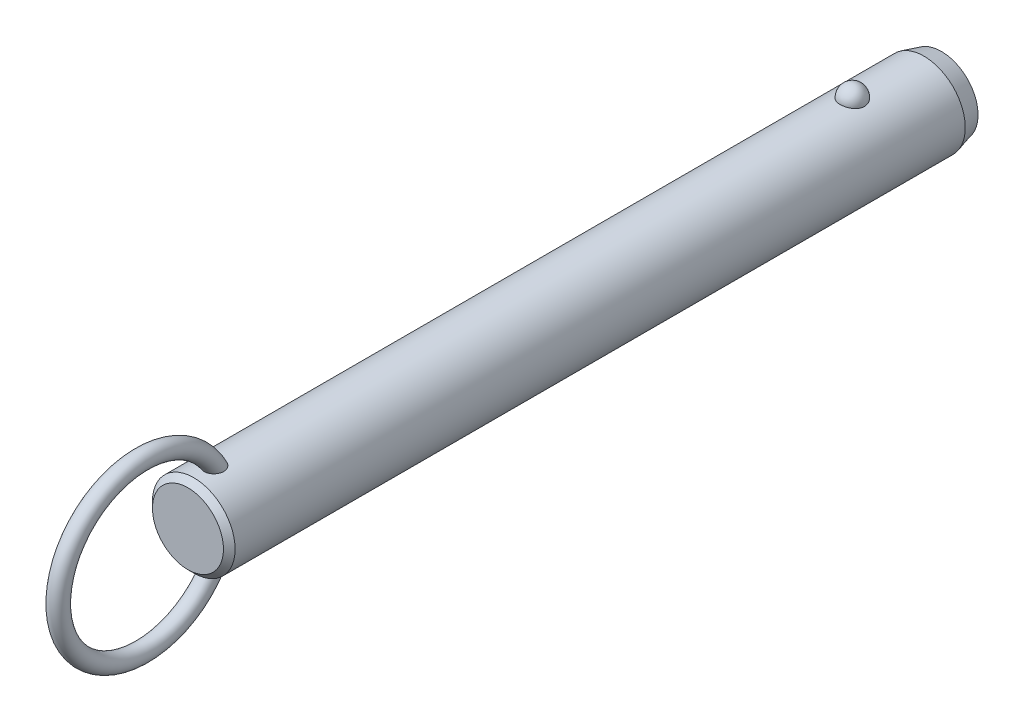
ISO-10303-21;
HEADER;
FILE_DESCRIPTION(('STEP AP214'),'2;1');
FILE_NAME('part.step','',(''),(''),'','','');
FILE_SCHEMA(('AUTOMOTIVE_DESIGN { 1 0 10303 214 1 1 1 1 }'));
ENDSEC;
DATA;
#1=APPLICATION_CONTEXT('core data for automotive mechanical design processes');
#2=APPLICATION_PROTOCOL_DEFINITION('international standard','automotive_design',2000,#1);
#3=PRODUCT_CONTEXT('',#1,'mechanical');
#4=PRODUCT('Part','Part','',(#3));
#5=PRODUCT_RELATED_PRODUCT_CATEGORY('part','',(#4));
#6=PRODUCT_DEFINITION_FORMATION('','',#4);
#7=PRODUCT_DEFINITION_CONTEXT('part definition',#1,'design');
#8=PRODUCT_DEFINITION('design','',#6,#7);
#9=PRODUCT_DEFINITION_SHAPE('','',#8);
#10=(LENGTH_UNIT() NAMED_UNIT(*) SI_UNIT(.MILLI.,.METRE.));
#11=(NAMED_UNIT(*) PLANE_ANGLE_UNIT() SI_UNIT($,.RADIAN.));
#12=(NAMED_UNIT(*) SI_UNIT($,.STERADIAN.) SOLID_ANGLE_UNIT());
#13=UNCERTAINTY_MEASURE_WITH_UNIT(LENGTH_MEASURE(1.E-05),#10,'distance_accuracy_value','');
#14=(GEOMETRIC_REPRESENTATION_CONTEXT(3) GLOBAL_UNCERTAINTY_ASSIGNED_CONTEXT((#13)) GLOBAL_UNIT_ASSIGNED_CONTEXT((#10,
#11,#12)) REPRESENTATION_CONTEXT('',''));
#15=CARTESIAN_POINT('',(0.,0.,0.));
#16=DIRECTION('',(0.,0.,1.));
#17=DIRECTION('',(1.,0.,0.));
#18=AXIS2_PLACEMENT_3D('',#15,#16,#17);
#19=CARTESIAN_POINT('',(0.,0.,104.1));
#20=DIRECTION('',(0.,0.,-1.));
#21=DIRECTION('',(-1.,0.,0.));
#22=AXIS2_PLACEMENT_3D('',#19,#20,#21);
#23=CYLINDRICAL_SURFACE('',#22,7.1);
#24=CARTESIAN_POINT('',(2.0769088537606,6.78943661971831,-2.1));
#25=CARTESIAN_POINT('',(2.07690739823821,6.78943796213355,-1.98268154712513));
#26=CARTESIAN_POINT('',(2.06738130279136,6.79237331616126,-1.86534506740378));
#27=CARTESIAN_POINT('',(2.0295040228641,6.8037853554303,-1.63400788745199));
#28=CARTESIAN_POINT('',(2.00114757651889,6.81226358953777,-1.52000812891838));
#29=CARTESIAN_POINT('',(1.92632025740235,6.83379798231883,-1.29863433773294));
#30=CARTESIAN_POINT('',(1.87985726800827,6.84685214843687,-1.19125744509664));
#31=CARTESIAN_POINT('',(1.76995205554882,6.87608091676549,-0.98604657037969));
#32=CARTESIAN_POINT('',(1.70650980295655,6.8922555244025,-0.88821260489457));
#33=CARTESIAN_POINT('',(1.5638119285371,6.92602930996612,-0.704242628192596));
#34=CARTESIAN_POINT('',(1.4844714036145,6.94363582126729,-0.618173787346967));
#35=CARTESIAN_POINT('',(1.31221746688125,6.97823658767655,-0.460740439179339));
#36=CARTESIAN_POINT('',(1.21930409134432,6.99523084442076,-0.389375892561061));
#37=CARTESIAN_POINT('',(1.02268781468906,7.02666176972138,-0.263547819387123));
#38=CARTESIAN_POINT('',(0.91902009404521,7.04110638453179,-0.209031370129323));
#39=CARTESIAN_POINT('',(0.703548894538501,7.06588726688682,-0.118163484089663));
#40=CARTESIAN_POINT('',(0.591746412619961,7.07622403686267,-0.0818098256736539));
#41=CARTESIAN_POINT('',(0.365557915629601,7.09147068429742,-0.0288711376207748));
#42=CARTESIAN_POINT('',(0.251267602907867,7.09648447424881,-0.0119070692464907));
#43=CARTESIAN_POINT('',(0.0213499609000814,7.10089837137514,0.00304925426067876));
#44=CARTESIAN_POINT('',(-0.0942772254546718,7.10029907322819,0.00104351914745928));
#45=CARTESIAN_POINT('',(-0.321651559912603,7.09360829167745,-0.0216931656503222));
#46=CARTESIAN_POINT('',(-0.433431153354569,7.08760388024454,-0.0421272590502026));
#47=CARTESIAN_POINT('',(-0.651862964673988,7.07086131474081,-0.100729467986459));
#48=CARTESIAN_POINT('',(-0.758515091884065,7.06012307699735,-0.138897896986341));
#49=CARTESIAN_POINT('',(-0.964449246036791,7.03496097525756,-0.232213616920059));
#50=CARTESIAN_POINT('',(-1.06368095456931,7.02051445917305,-0.287465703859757));
#51=CARTESIAN_POINT('',(-1.25145353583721,6.98948740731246,-0.413383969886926));
#52=CARTESIAN_POINT('',(-1.33999321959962,6.97290663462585,-0.48405186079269));
#53=CARTESIAN_POINT('',(-1.50591604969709,6.93898770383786,-0.640594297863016));
#54=CARTESIAN_POINT('',(-1.58302488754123,6.92164094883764,-0.726757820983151));
#55=CARTESIAN_POINT('',(-1.72189320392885,6.8884103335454,-0.91092752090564));
#56=CARTESIAN_POINT('',(-1.78365144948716,6.87252659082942,-1.008934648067));
#57=CARTESIAN_POINT('',(-1.89101272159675,6.84377189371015,-1.21549497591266));
#58=CARTESIAN_POINT('',(-1.93639553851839,6.83094274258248,-1.32416860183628));
#59=CARTESIAN_POINT('',(-2.00874275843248,6.81002070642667,-1.54791500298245));
#60=CARTESIAN_POINT('',(-2.03570774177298,6.80192767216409,-1.66298757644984));
#61=CARTESIAN_POINT('',(-2.07047276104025,6.7914266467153,-1.89571453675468));
#62=CARTESIAN_POINT('',(-2.07835878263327,6.78899315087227,-2.01335491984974));
#63=CARTESIAN_POINT('',(-2.07502083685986,6.79001409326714,-2.24833570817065));
#64=CARTESIAN_POINT('',(-2.06379746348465,6.7934683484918,-2.36567612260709));
#65=CARTESIAN_POINT('',(-2.02263913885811,6.80583442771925,-2.59603194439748));
#66=CARTESIAN_POINT('',(-1.99281127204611,6.81471501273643,-2.70906820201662));
#67=CARTESIAN_POINT('',(-1.91526639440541,6.83691232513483,-2.92836575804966));
#68=CARTESIAN_POINT('',(-1.8675486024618,6.85022924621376,-3.03462676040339));
#69=CARTESIAN_POINT('',(-1.75504492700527,6.87991336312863,-3.23806487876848));
#70=CARTESIAN_POINT('',(-1.69015924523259,6.89629822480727,-3.33518422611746));
#71=CARTESIAN_POINT('',(-1.54505404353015,6.93024852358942,-3.51697105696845));
#72=CARTESIAN_POINT('',(-1.46483385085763,6.94781401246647,-3.60163799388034));
#73=CARTESIAN_POINT('',(-1.29071406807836,6.98225977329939,-3.75654119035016));
#74=CARTESIAN_POINT('',(-1.19675650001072,6.99913673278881,-3.82671308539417));
#75=CARTESIAN_POINT('',(-0.997940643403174,7.03023618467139,-3.9501837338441));
#76=CARTESIAN_POINT('',(-0.89308318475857,7.04445887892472,-4.00348377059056));
#77=CARTESIAN_POINT('',(-0.676902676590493,7.06848365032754,-4.09107242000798));
#78=CARTESIAN_POINT('',(-0.565686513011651,7.0783430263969,-4.12560889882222));
#79=CARTESIAN_POINT('',(-0.338739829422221,7.09282534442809,-4.17575450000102));
#80=CARTESIAN_POINT('',(-0.223009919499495,7.09744899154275,-4.19136617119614));
#81=CARTESIAN_POINT('',(0.00707628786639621,7.10090930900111,-4.20307965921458));
#82=CARTESIAN_POINT('',(0.121410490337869,7.09986531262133,-4.19958377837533));
#83=CARTESIAN_POINT('',(0.347815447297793,7.092380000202,-4.17411564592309));
#84=CARTESIAN_POINT('',(0.459886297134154,7.08593891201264,-4.15214417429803));
#85=CARTESIAN_POINT('',(0.678084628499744,7.06838983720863,-4.09049562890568));
#86=CARTESIAN_POINT('',(0.784237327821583,7.05730369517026,-4.05090137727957));
#87=CARTESIAN_POINT('',(0.988305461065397,7.03163139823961,-3.95511447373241));
#88=CARTESIAN_POINT('',(1.08622031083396,7.01704499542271,-3.89892064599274));
#89=CARTESIAN_POINT('',(1.27284490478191,6.98562668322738,-3.77035541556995));
#90=CARTESIAN_POINT('',(1.36137372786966,6.96876135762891,-3.69772964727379));
#91=CARTESIAN_POINT('',(1.52509486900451,6.93477412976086,-3.53878279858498));
#92=CARTESIAN_POINT('',(1.60028496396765,6.91765218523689,-3.45245943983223));
#93=CARTESIAN_POINT('',(1.73681688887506,6.88465753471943,-3.26658774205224));
#94=CARTESIAN_POINT('',(1.79785966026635,6.86881574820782,-3.16681408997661));
#95=CARTESIAN_POINT('',(1.90265327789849,6.84053157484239,-2.95814408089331));
#96=CARTESIAN_POINT('',(1.94640861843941,6.82808830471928,-2.84925010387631));
#97=CARTESIAN_POINT('',(2.01274378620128,6.80881460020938,-2.63454318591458));
#98=CARTESIAN_POINT('',(2.03676193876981,6.80160856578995,-2.52920574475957));
#99=CARTESIAN_POINT('',(2.06884490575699,6.79191902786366,-2.3159172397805));
#100=CARTESIAN_POINT('',(2.07691019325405,6.78943538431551,-2.20796625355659));
#101=CARTESIAN_POINT('',(2.0769088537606,6.78943661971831,-2.1));
#102=B_SPLINE_CURVE_WITH_KNOTS('',3,(#24,#25,#26,#27,#28,#29,#30,#31,#32,#33,#34,#35,#36,#37,
#38,#39,#40,#41,#42,#43,#44,#45,#46,#47,#48,#49,#50,#51,#52,#53,#54,#55,#56,#57,#58,#59,#60,#61,
#62,#63,#64,#65,#66,#67,#68,#69,#70,#71,#72,#73,#74,#75,#76,#77,#78,#79,#80,#81,#82,#83,#84,#85,
#86,#87,#88,#89,#90,#91,#92,#93,#94,#95,#96,#97,#98,#99,#100,#101),.UNSPECIFIED.,.T.,.F.,(4,2,2,
2,2,2,2,2,2,2,2,2,2,2,2,2,2,2,2,2,2,2,2,2,2,2,2,2,2,2,2,2,2,2,2,2,2,2,4),(0.,0.351568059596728,
0.703234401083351,1.05474780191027,1.40626181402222,1.75970563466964,2.11314851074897,
2.4654696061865,2.81774759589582,3.16301449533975,3.50824481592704,3.84801136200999,
4.18778391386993,4.52968352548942,4.87162112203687,5.22076181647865,5.56993054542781,
5.92363364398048,6.27732559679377,6.62942052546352,6.98150450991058,7.33158042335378,
7.68167162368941,8.03384443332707,8.38603269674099,8.73975272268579,9.09344583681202,
9.44234545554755,9.79119807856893,10.1327344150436,10.4742563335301,10.8141898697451,
11.1541474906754,11.4997793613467,11.8454687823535,12.1979079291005,12.5502553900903,
12.8738073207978,13.1973496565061),.UNSPECIFIED.);
#103=CARTESIAN_POINT('',(2.0769088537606,6.78943661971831,-2.1));
#104=VERTEX_POINT('',#103);
#105=EDGE_CURVE('E41',#104,#104,#102,.T.);
#106=ORIENTED_EDGE('',*,*,#105,.T.);
#107=EDGE_LOOP('',(#106));
#108=FACE_BOUND('',#107,.T.);
#109=CARTESIAN_POINT('',(0.,0.,111.02));
#110=DIRECTION('',(0.,0.,1.));
#111=DIRECTION('',(1.,0.,0.));
#112=AXIS2_PLACEMENT_3D('',#109,#110,#111);
#113=CIRCLE('',#112,7.1);
#114=CARTESIAN_POINT('',(7.1,0.,111.02));
#115=VERTEX_POINT('',#114);
#116=EDGE_CURVE('E10',#115,#115,#113,.F.);
#117=ORIENTED_EDGE('',*,*,#116,.T.);
#118=EDGE_LOOP('',(#117));
#119=FACE_BOUND('',#118,.T.);
#120=CARTESIAN_POINT('',(-0.429539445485,-7.08699541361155,105.842921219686));
#121=CARTESIAN_POINT('',(-0.508331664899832,-7.08221999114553,105.866876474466));
#122=CARTESIAN_POINT('',(-0.58503984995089,-7.07624016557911,105.897457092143));
#123=CARTESIAN_POINT('',(-0.732082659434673,-7.06254296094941,105.971024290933));
#124=CARTESIAN_POINT('',(-0.802417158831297,-7.05482554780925,106.014011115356));
#125=CARTESIAN_POINT('',(-0.934722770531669,-7.03851844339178,106.111113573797));
#126=CARTESIAN_POINT('',(-0.99670020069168,-7.02992941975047,106.165220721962));
#127=CARTESIAN_POINT('',(-1.11079942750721,-7.01280697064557,106.282967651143));
#128=CARTESIAN_POINT('',(-1.16292136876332,-7.00427354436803,106.346607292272));
#129=CARTESIAN_POINT('',(-1.25705660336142,-6.98799959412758,106.482687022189));
#130=CARTESIAN_POINT('',(-1.29888032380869,-6.98027525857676,106.555259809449));
#131=CARTESIAN_POINT('',(-1.37069920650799,-6.96652886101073,106.706168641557));
#132=CARTESIAN_POINT('',(-1.40069157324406,-6.96050720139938,106.784506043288));
#133=CARTESIAN_POINT('',(-1.45043507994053,-6.95031881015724,106.950190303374));
#134=CARTESIAN_POINT('',(-1.46937115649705,-6.94630231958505,107.037789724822));
#135=CARTESIAN_POINT('',(-1.49424917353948,-6.94099239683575,107.214871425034));
#136=CARTESIAN_POINT('',(-1.50018601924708,-6.93970003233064,107.304354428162));
#137=CARTESIAN_POINT('',(-1.49978214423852,-6.93978815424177,107.494060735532));
#138=CARTESIAN_POINT('',(-1.49187639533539,-6.94150934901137,107.594279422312));
#139=CARTESIAN_POINT('',(-1.46177925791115,-6.94790814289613,107.792479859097));
#140=CARTESIAN_POINT('',(-1.43957541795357,-6.95258831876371,107.890459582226));
#141=CARTESIAN_POINT('',(-1.37783293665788,-6.96510647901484,108.09536292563));
#142=CARTESIAN_POINT('',(-1.33634073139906,-6.97328848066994,108.201680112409));
#143=CARTESIAN_POINT('',(-1.23686994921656,-6.99161706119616,108.406177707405));
#144=CARTESIAN_POINT('',(-1.17889192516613,-7.00176357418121,108.504358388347));
#145=CARTESIAN_POINT('',(-1.0587512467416,-7.02082898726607,108.672374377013));
#146=CARTESIAN_POINT('',(-0.999247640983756,-7.02963746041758,108.744123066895));
#147=CARTESIAN_POINT('',(-0.869494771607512,-7.04686074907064,108.877195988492));
#148=CARTESIAN_POINT('',(-0.799263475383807,-7.05527619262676,108.938537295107));
#149=CARTESIAN_POINT('',(-0.665408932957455,-7.06899457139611,109.035131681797));
#150=CARTESIAN_POINT('',(-0.603817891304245,-7.07457275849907,109.073151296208));
#151=CARTESIAN_POINT('',(-0.47517283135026,-7.08437420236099,109.138758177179));
#152=CARTESIAN_POINT('',(-0.408123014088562,-7.08859848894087,109.166353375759));
#153=CARTESIAN_POINT('',(-0.269431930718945,-7.09522749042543,109.209256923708));
#154=CARTESIAN_POINT('',(-0.197757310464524,-7.09761688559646,109.224461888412));
#155=CARTESIAN_POINT('',(-0.0527849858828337,-7.10017268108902,109.240716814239));
#156=CARTESIAN_POINT('',(0.0205115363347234,-7.10034065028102,109.241776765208));
#157=CARTESIAN_POINT('',(0.156426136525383,-7.09855986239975,109.230461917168));
#158=CARTESIAN_POINT('',(0.219199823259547,-7.09688191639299,109.219806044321));
#159=CARTESIAN_POINT('',(0.342134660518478,-7.09201880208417,109.188537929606));
#160=CARTESIAN_POINT('',(0.402295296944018,-7.08883333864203,109.167923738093));
#161=CARTESIAN_POINT('',(0.520687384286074,-7.08113868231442,109.117212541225));
#162=CARTESIAN_POINT('',(0.578791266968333,-7.07658958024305,109.086827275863));
#163=CARTESIAN_POINT('',(0.690173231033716,-7.06659708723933,109.018367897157));
#164=CARTESIAN_POINT('',(0.743447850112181,-7.061153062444,108.980288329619));
#165=CARTESIAN_POINT('',(0.870947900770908,-7.04680292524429,108.876592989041));
#166=CARTESIAN_POINT('',(0.941828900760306,-7.0375580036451,108.806897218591));
#167=CARTESIAN_POINT('',(1.07136606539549,-7.01900793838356,108.656945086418));
#168=CARTESIAN_POINT('',(1.13000013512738,-7.00970271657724,108.576670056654));
#169=CARTESIAN_POINT('',(1.23579584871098,-6.99183327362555,108.406899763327));
#170=CARTESIAN_POINT('',(1.2827427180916,-6.98328455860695,108.317269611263));
#171=CARTESIAN_POINT('',(1.36351442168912,-6.96796352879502,108.132176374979));
#172=CARTESIAN_POINT('',(1.39733971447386,-6.96119115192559,108.036713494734));
#173=CARTESIAN_POINT('',(1.45579181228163,-6.94922464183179,107.82530928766));
#174=CARTESIAN_POINT('',(1.47790145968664,-6.94449000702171,107.708631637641));
#175=CARTESIAN_POINT('',(1.50168752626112,-6.93938731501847,107.473015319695));
#176=CARTESIAN_POINT('',(1.50336085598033,-6.93901991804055,107.35407631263));
#177=CARTESIAN_POINT('',(1.48486516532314,-6.9430010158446,107.12360799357));
#178=CARTESIAN_POINT('',(1.46573441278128,-6.9471253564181,107.011995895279));
#179=CARTESIAN_POINT('',(1.40606892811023,-6.95944667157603,106.794886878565));
#180=CARTESIAN_POINT('',(1.36556446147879,-6.96763788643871,106.6893815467));
#181=CARTESIAN_POINT('',(1.27082700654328,-6.98548038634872,106.504287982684));
#182=CARTESIAN_POINT('',(1.21949810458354,-6.99473841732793,106.423171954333));
#183=CARTESIAN_POINT('',(1.10242050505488,-7.01414069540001,106.272227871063));
#184=CARTESIAN_POINT('',(1.03668119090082,-7.02428436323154,106.20239252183));
#185=CARTESIAN_POINT('',(0.900559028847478,-7.04295285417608,106.083573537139));
#186=CARTESIAN_POINT('',(0.83142884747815,-7.05153466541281,106.033157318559));
#187=CARTESIAN_POINT('',(0.68529187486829,-7.06723150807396,105.945142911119));
#188=CARTESIAN_POINT('',(0.608287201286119,-7.0743469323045,105.907541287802));
#189=CARTESIAN_POINT('',(0.451878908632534,-7.08602232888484,105.847491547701));
#190=CARTESIAN_POINT('',(0.372686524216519,-7.09067127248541,105.824508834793));
#191=CARTESIAN_POINT('',(0.211477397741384,-7.09730788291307,105.792035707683));
#192=CARTESIAN_POINT('',(0.129460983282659,-7.09929585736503,105.78254373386));
#193=CARTESIAN_POINT('',(-0.0332905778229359,-7.10037858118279,105.777351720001));
#194=CARTESIAN_POINT('',(-0.114016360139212,-7.09953334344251,105.781365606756));
#195=CARTESIAN_POINT('',(-0.273670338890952,-7.09517338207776,105.802454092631));
#196=CARTESIAN_POINT('',(-0.352598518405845,-7.09165863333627,105.819528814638));
#197=CARTESIAN_POINT('',(-0.429539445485,-7.08699541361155,105.842921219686));
#198=B_SPLINE_CURVE_WITH_KNOTS('',3,(#120,#121,#122,#123,#124,#125,#126,#127,#128,#129,#130,
#131,#132,#133,#134,#135,#136,#137,#138,#139,#140,#141,#142,#143,#144,#145,#146,#147,#148,#149,
#150,#151,#152,#153,#154,#155,#156,#157,#158,#159,#160,#161,#162,#163,#164,#165,#166,#167,#168,
#169,#170,#171,#172,#173,#174,#175,#176,#177,#178,#179,#180,#181,#182,#183,#184,#185,#186,#187,
#188,#189,#190,#191,#192,#193,#194,#195,#196,#197),.UNSPECIFIED.,.T.,.F.,(4,2,2,2,2,2,2,2,2,2,2,
2,2,2,2,2,2,2,2,2,2,2,2,2,2,2,2,2,2,2,2,2,2,2,2,2,2,2,4),(0.,0.247183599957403,
0.494372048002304,0.741372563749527,0.988369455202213,1.23962059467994,1.49093106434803,
1.75897818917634,2.02713035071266,2.3275826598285,2.62829697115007,2.97008736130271,
3.31186629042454,3.59175319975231,3.87117637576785,4.08813841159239,4.30493502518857,
4.52352259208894,4.74195577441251,4.9321532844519,5.12238804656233,5.31884850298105,
5.51544871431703,5.81332317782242,6.11173048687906,6.4152726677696,6.71880423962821,
7.07358156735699,7.42841252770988,7.76631485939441,8.10373999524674,8.39142246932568,
8.67891817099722,8.93560332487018,9.19221962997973,9.43881106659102,9.68537399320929,
9.92674752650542,10.1681233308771),.UNSPECIFIED.);
#199=CARTESIAN_POINT('',(-0.429539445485,-7.08699541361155,105.842921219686));
#200=VERTEX_POINT('',#199);
#201=EDGE_CURVE('E60',#200,#200,#198,.T.);
#202=ORIENTED_EDGE('',*,*,#201,.T.);
#203=EDGE_LOOP('',(#202));
#204=FACE_BOUND('',#203,.T.);
#205=CARTESIAN_POINT('',(-0.429539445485,7.08699541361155,105.842921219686));
#206=CARTESIAN_POINT('',(-0.351665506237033,7.09171429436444,105.819246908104));
#207=CARTESIAN_POINT('',(-0.271733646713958,7.09525896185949,105.802036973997));
#208=CARTESIAN_POINT('',(-0.110026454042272,7.09960839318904,105.781005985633));
#209=CARTESIAN_POINT('',(-0.0282502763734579,7.10041187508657,105.777191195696));
#210=CARTESIAN_POINT('',(0.134782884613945,7.09918849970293,105.783059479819));
#211=CARTESIAN_POINT('',(0.21603995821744,7.09716214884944,105.79274013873));
#212=CARTESIAN_POINT('',(0.375730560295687,7.09050177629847,105.825347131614));
#213=CARTESIAN_POINT('',(0.454164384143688,7.08586802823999,105.848272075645));
#214=CARTESIAN_POINT('',(0.60602533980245,7.07449911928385,105.906771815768));
#215=CARTESIAN_POINT('',(0.679451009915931,7.06776334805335,105.942350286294));
#216=CARTESIAN_POINT('',(0.819234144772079,7.05292866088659,106.025175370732));
#217=CARTESIAN_POINT('',(0.885591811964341,7.04482978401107,106.072421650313));
#218=CARTESIAN_POINT('',(1.00993211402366,7.02808709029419,106.177590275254));
#219=CARTESIAN_POINT('',(1.06785399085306,7.01943990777,106.235583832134));
#220=CARTESIAN_POINT('',(1.17342527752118,7.00256662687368,106.360301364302));
#221=CARTESIAN_POINT('',(1.22107408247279,6.99434055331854,106.427025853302));
#222=CARTESIAN_POINT('',(1.30652927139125,6.97889183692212,106.569362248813));
#223=CARTESIAN_POINT('',(1.34399711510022,6.97170674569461,106.645180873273));
#224=CARTESIAN_POINT('',(1.40682616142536,6.95930080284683,106.801810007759));
#225=CARTESIAN_POINT('',(1.43218374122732,6.95408053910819,106.88262200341));
#226=CARTESIAN_POINT('',(1.47246409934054,6.94566853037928,107.053531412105));
#227=CARTESIAN_POINT('',(1.48642590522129,6.9426653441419,107.14386307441));
#228=CARTESIAN_POINT('',(1.5011410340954,6.93949744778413,107.325619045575));
#229=CARTESIAN_POINT('',(1.50188917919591,6.93933385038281,107.417043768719));
#230=CARTESIAN_POINT('',(1.49030464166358,6.94183245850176,107.61084381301));
#231=CARTESIAN_POINT('',(1.47627413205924,6.94486147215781,107.713112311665));
#232=CARTESIAN_POINT('',(1.43356351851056,6.95380194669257,107.914471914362));
#233=CARTESIAN_POINT('',(1.4048676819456,6.95971650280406,108.013559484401));
#234=CARTESIAN_POINT('',(1.32908750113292,6.97461208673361,108.218908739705));
#235=CARTESIAN_POINT('',(1.28011435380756,6.98388945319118,108.324456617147));
#236=CARTESIAN_POINT('',(1.16520357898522,7.00397743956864,108.525760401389));
#237=CARTESIAN_POINT('',(1.09927694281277,7.01478706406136,108.621522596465));
#238=CARTESIAN_POINT('',(0.969361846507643,7.03373936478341,108.776756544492));
#239=CARTESIAN_POINT('',(0.909042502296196,7.04187023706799,108.839303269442));
#240=CARTESIAN_POINT('',(0.779178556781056,7.05741732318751,108.954053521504));
#241=CARTESIAN_POINT('',(0.709649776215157,7.06483472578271,109.006274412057));
#242=CARTESIAN_POINT('',(0.576854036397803,7.0767751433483,109.088113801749));
#243=CARTESIAN_POINT('',(0.515118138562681,7.08158033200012,109.120164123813));
#244=CARTESIAN_POINT('',(0.387127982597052,7.08972701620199,109.173765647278));
#245=CARTESIAN_POINT('',(0.320877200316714,7.09306962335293,109.195324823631));
#246=CARTESIAN_POINT('',(0.185041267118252,7.09791507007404,109.226400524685));
#247=CARTESIAN_POINT('',(0.115437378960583,7.09940591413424,109.235838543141));
#248=CARTESIAN_POINT('',(-0.0243157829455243,7.10030171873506,109.241522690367));
#249=CARTESIAN_POINT('',(-0.0944648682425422,7.0997073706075,109.237773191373));
#250=CARTESIAN_POINT('',(-0.225713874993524,7.09668414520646,109.218508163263));
#251=CARTESIAN_POINT('',(-0.287006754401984,7.09444865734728,109.204232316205));
#252=CARTESIAN_POINT('',(-0.40655537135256,7.08860360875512,109.166368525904));
#253=CARTESIAN_POINT('',(-0.46480981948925,7.08499346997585,109.142776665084));
#254=CARTESIAN_POINT('',(-0.594955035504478,7.07541654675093,109.078923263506));
#255=CARTESIAN_POINT('',(-0.665389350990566,7.06906574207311,109.035753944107));
#256=CARTESIAN_POINT('',(-0.798242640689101,7.05530261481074,108.938587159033));
#257=CARTESIAN_POINT('',(-0.860645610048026,7.0478882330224,108.884568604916));
#258=CARTESIAN_POINT('',(-0.994249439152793,7.03045217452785,108.750996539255));
#259=CARTESIAN_POINT('',(-1.06260129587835,7.02030745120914,108.668614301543));
#260=CARTESIAN_POINT('',(-1.18502045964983,7.00068382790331,108.493843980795));
#261=CARTESIAN_POINT('',(-1.23907684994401,6.99120544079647,108.401448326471));
#262=CARTESIAN_POINT('',(-1.33335589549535,6.97384343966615,108.208008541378));
#263=CARTESIAN_POINT('',(-1.3733613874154,6.96598557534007,108.106856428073));
#264=CARTESIAN_POINT('',(-1.43770677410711,6.9529905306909,107.899504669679));
#265=CARTESIAN_POINT('',(-1.46204473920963,6.94785368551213,107.79330440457));
#266=CARTESIAN_POINT('',(-1.49537533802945,6.94076296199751,107.568231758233));
#267=CARTESIAN_POINT('',(-1.50273564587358,6.93914842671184,107.44909751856));
#268=CARTESIAN_POINT('',(-1.4954555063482,6.94072368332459,107.211470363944));
#269=CARTESIAN_POINT('',(-1.48082914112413,6.94391040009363,107.092977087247));
#270=CARTESIAN_POINT('',(-1.43076401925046,6.95438579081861,106.873432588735));
#271=CARTESIAN_POINT('',(-1.39762227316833,6.96121852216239,106.771841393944));
#272=CARTESIAN_POINT('',(-1.31211274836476,6.97783941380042,106.577351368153));
#273=CARTESIAN_POINT('',(-1.2597660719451,6.98762432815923,106.48444313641));
#274=CARTESIAN_POINT('',(-1.14583073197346,7.00713153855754,106.324160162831));
#275=CARTESIAN_POINT('',(-1.0866594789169,7.01665982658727,106.255035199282));
#276=CARTESIAN_POINT('',(-0.956606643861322,7.03556646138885,106.128878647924));
#277=CARTESIAN_POINT('',(-0.885737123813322,7.04494495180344,106.071834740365));
#278=CARTESIAN_POINT('',(-0.751558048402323,7.06035735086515,105.983100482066));
#279=CARTESIAN_POINT('',(-0.690120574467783,7.0666695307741,105.948593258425));
#280=CARTESIAN_POINT('',(-0.56281546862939,7.07794609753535,105.888750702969));
#281=CARTESIAN_POINT('',(-0.496948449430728,7.08291067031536,105.863414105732));
#282=CARTESIAN_POINT('',(-0.429539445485,7.08699541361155,105.842921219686));
#283=B_SPLINE_CURVE_WITH_KNOTS('',3,(#205,#206,#207,#208,#209,#210,#211,#212,#213,#214,#215,
#216,#217,#218,#219,#220,#221,#222,#223,#224,#225,#226,#227,#228,#229,#230,#231,#232,#233,#234,
#235,#236,#237,#238,#239,#240,#241,#242,#243,#244,#245,#246,#247,#248,#249,#250,#251,#252,#253,
#254,#255,#256,#257,#258,#259,#260,#261,#262,#263,#264,#265,#266,#267,#268,#269,#270,#271,#272,
#273,#274,#275,#276,#277,#278,#279,#280,#281,#282),.UNSPECIFIED.,.T.,.F.,(4,2,2,2,2,2,2,2,2,2,2,
2,2,2,2,2,2,2,2,2,2,2,2,2,2,2,2,2,2,2,2,2,2,2,2,2,2,2,4),(0.,0.244335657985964,
0.488785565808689,0.733191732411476,0.977572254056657,1.22202379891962,1.46646834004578,
1.71259457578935,1.95873529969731,2.21226768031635,2.46587585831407,2.7391381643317,
3.01250754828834,3.32109936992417,3.63002293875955,3.97863512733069,4.32702187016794,
4.58793945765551,4.84841449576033,5.05676704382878,5.26496096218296,5.47449661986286,
5.68396281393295,5.87205447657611,6.06022532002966,6.30743751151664,6.55513496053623,
6.87602468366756,7.19715875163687,7.52305774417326,7.84899686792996,8.20516155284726,
8.56109821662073,8.8804008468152,9.19935367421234,9.47236282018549,9.74509220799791,
9.95662250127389,10.1681235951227),.UNSPECIFIED.);
#284=CARTESIAN_POINT('',(-0.429539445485,7.08699541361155,105.842921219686));
#285=VERTEX_POINT('',#284);
#286=EDGE_CURVE('E67',#285,#285,#283,.T.);
#287=ORIENTED_EDGE('',*,*,#286,.T.);
#288=EDGE_LOOP('',(#287));
#289=FACE_BOUND('',#288,.T.);
#290=CARTESIAN_POINT('',(0.,0.,-14.4));
#291=DIRECTION('',(0.,0.,-1.));
#292=DIRECTION('',(-1.,0.,0.));
#293=AXIS2_PLACEMENT_3D('',#290,#291,#292);
#294=CIRCLE('',#293,7.1);
#295=CARTESIAN_POINT('',(-7.1,0.,-14.4));
#296=VERTEX_POINT('',#295);
#297=EDGE_CURVE('E57',#296,#296,#294,.F.);
#298=ORIENTED_EDGE('',*,*,#297,.T.);
#299=EDGE_LOOP('',(#298));
#300=FACE_BOUND('',#299,.T.);
#301=ADVANCED_FACE('F37',(#108,#119,#204,#289,#300),#23,.T.);
#302=CARTESIAN_POINT('',(0.,0.,-17.4));
#303=DIRECTION('',(0.,0.,-1.));
#304=DIRECTION('',(-1.,0.,0.));
#305=AXIS2_PLACEMENT_3D('',#302,#303,#304);
#306=PLANE('',#305);
#307=CARTESIAN_POINT('',(0.,0.,-17.4));
#308=DIRECTION('',(0.,0.,-1.));
#309=DIRECTION('',(-1.,0.,0.));
#310=AXIS2_PLACEMENT_3D('',#307,#308,#309);
#311=CIRCLE('',#310,6.29615242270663);
#312=CARTESIAN_POINT('',(-6.29615242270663,0.,-17.4));
#313=VERTEX_POINT('',#312);
#314=EDGE_CURVE('E66',#313,#313,#311,.T.);
#315=ORIENTED_EDGE('',*,*,#314,.T.);
#316=EDGE_LOOP('',(#315));
#317=FACE_BOUND('',#316,.T.);
#318=ADVANCED_FACE('F85',(#317),#306,.T.);
#319=CARTESIAN_POINT('',(0.,0.,-17.4));
#320=DIRECTION('',(0.,0.,1.));
#321=DIRECTION('',(1.,0.,0.));
#322=AXIS2_PLACEMENT_3D('',#319,#320,#321);
#323=CONICAL_SURFACE('',#322,6.29615242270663,0.261799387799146);
#324=ORIENTED_EDGE('',*,*,#297,.F.);
#325=EDGE_LOOP('',(#324));
#326=FACE_BOUND('',#325,.T.);
#327=ORIENTED_EDGE('',*,*,#314,.F.);
#328=EDGE_LOOP('',(#327));
#329=FACE_BOUND('',#328,.T.);
#330=ADVANCED_FACE('F83',(#326,#329),#323,.T.);
#331=CARTESIAN_POINT('',(0.,0.,112.02));
#332=DIRECTION('',(0.,0.,1.));
#333=DIRECTION('',(1.,0.,0.));
#334=AXIS2_PLACEMENT_3D('',#331,#332,#333);
#335=PLANE('',#334);
#336=CARTESIAN_POINT('',(0.,0.,112.02));
#337=DIRECTION('',(0.,0.,1.));
#338=DIRECTION('',(1.,0.,0.));
#339=AXIS2_PLACEMENT_3D('',#336,#337,#338);
#340=CIRCLE('',#339,6.10000000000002);
#341=CARTESIAN_POINT('',(6.10000000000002,0.,112.02));
#342=VERTEX_POINT('',#341);
#343=EDGE_CURVE('E50',#342,#342,#340,.T.);
#344=ORIENTED_EDGE('',*,*,#343,.T.);
#345=EDGE_LOOP('',(#344));
#346=FACE_BOUND('',#345,.T.);
#347=ADVANCED_FACE('F77',(#346),#335,.T.);
#348=CARTESIAN_POINT('',(0.,0.,119.95));
#349=DIRECTION('',(1.,0.,0.));
#350=DIRECTION('',(0.,0.,-1.));
#351=AXIS2_PLACEMENT_3D('',#348,#349,#350);
#352=TOROIDAL_SURFACE('',#351,14.35,1.5);
#353=ORIENTED_EDGE('',*,*,#286,.F.);
#354=EDGE_LOOP('',(#353));
#355=FACE_BOUND('',#354,.T.);
#356=ORIENTED_EDGE('',*,*,#201,.F.);
#357=EDGE_LOOP('',(#356));
#358=FACE_BOUND('',#357,.T.);
#359=ADVANCED_FACE('F73',(#355,#358),#352,.T.);
#360=CARTESIAN_POINT('',(0.,0.,112.02));
#361=DIRECTION('',(0.,0.,-1.));
#362=DIRECTION('',(-1.,0.,0.));
#363=AXIS2_PLACEMENT_3D('',#360,#361,#362);
#364=CONICAL_SURFACE('',#363,6.10000000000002,0.785398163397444);
#365=ORIENTED_EDGE('',*,*,#116,.F.);
#366=EDGE_LOOP('',(#365));
#367=FACE_BOUND('',#366,.T.);
#368=ORIENTED_EDGE('',*,*,#343,.F.);
#369=EDGE_LOOP('',(#368));
#370=FACE_BOUND('',#369,.T.);
#371=ADVANCED_FACE('F39',(#367,#370),#364,.T.);
#372=CARTESIAN_POINT('',(0.,7.1,-2.1));
#373=DIRECTION('',(0.,1.,0.));
#374=DIRECTION('',(0.,0.,1.));
#375=AXIS2_PLACEMENT_3D('',#372,#373,#374);
#376=SPHERICAL_SURFACE('',#375,2.10000000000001);
#377=ORIENTED_EDGE('',*,*,#105,.F.);
#378=EDGE_LOOP('',(#377));
#379=FACE_BOUND('',#378,.T.);
#380=ADVANCED_FACE('F79',(#379),#376,.T.);
#381=CLOSED_SHELL('',(#301,#318,#330,#347,#359,#371,#380));
#382=MANIFOLD_SOLID_BREP('B2',#381);
#383=ADVANCED_BREP_SHAPE_REPRESENTATION('',(#18,#382),#14);
#384=SHAPE_DEFINITION_REPRESENTATION(#9,#383);
ENDSEC;
END-ISO-10303-21;
